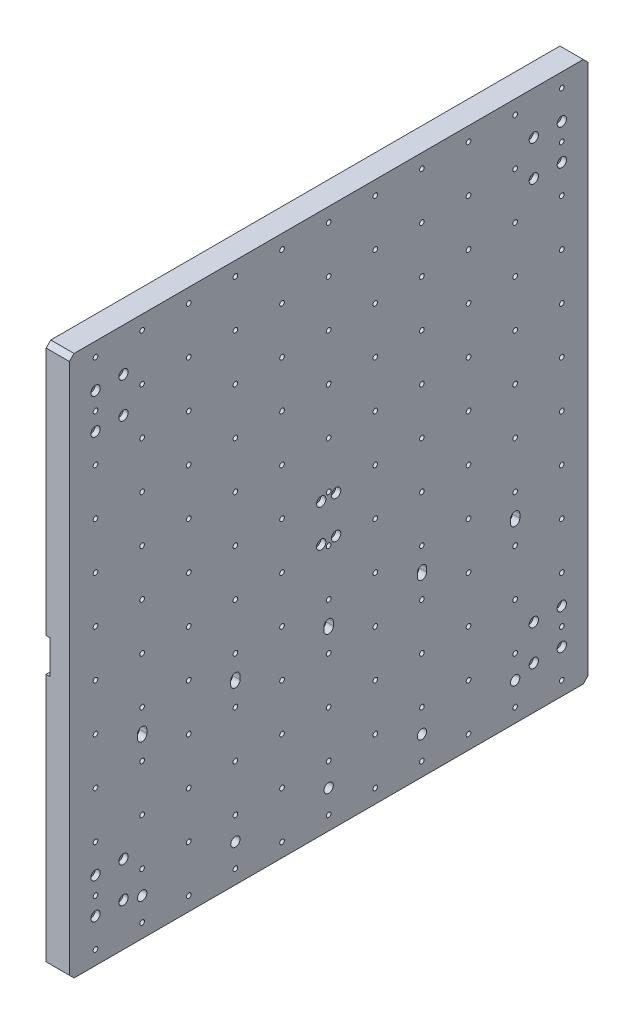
from build123d import *

# Parameters (mm, degrees)
ESQUISSE1_W                                        = 556
ESQUISSE1_H                                        = 580
BOSS_EXTRU_1_DEPTH                                 = 25
CHAMBRAGE_POUR_VIS_T_TE_HEXAGONALE_M51_D           = 5.5
CHAMBRAGE_POUR_VIS_T_TE_HEXAGONALE_M51_CBORE_D     = 10
CHAMBRAGE_POUR_VIS_T_TE_HEXAGONALE_M51_CBORE_DEPTH = 5.4
R_P_TITION_LIN_AIRE1_COUNT                         = 2
R_P_TITION_LIN_AIRE1_PITCH                         = 450
ENL_V_MAT_EXTRU_1_DEPTH                            = 4
ENL_V_MAT_EXTRU_2_DEPTH                            = 9
TROU_TARAUD_M31_D                                  = 2.5
TROU_TARAUD_M31_DEPTH                              = 7.5
TROU_TARAUD_M31_TIP                                = 0.751075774
R_P_TITION_LIN_AIRE2_COUNT                         = 11
R_P_TITION_LIN_AIRE2_PITCH                         = 50
R_P_TITION_LIN_AIRE2_COUNT_DIR2                    = 12
R_P_TITION_LIN_AIRE2_PITCH_DIR2                    = 50
CHANFREIN1_SIZE                                    = 5
ENL_V_MAT_EXTRU_3_DEPTH                            = 8
R_P_TITION_LIN_AIRE4_COUNT                         = 5
R_P_TITION_LIN_AIRE4_PITCH                         = 100
CHAMBRAGE_POUR_VIS_T_TE_HEXAGONALE_M52_D           = 5.5
CHAMBRAGE_POUR_VIS_T_TE_HEXAGONALE_M52_CBORE_D     = 10
CHAMBRAGE_POUR_VIS_T_TE_HEXAGONALE_M52_CBORE_DEPTH = 5.4
ENL_V_MAT_EXTRU_4_DEPTH                            = 4


with BuildPart() as part:
    # Esquisse1 → Boss.-Extru.1 (new body)
    with BuildSketch(Plane(origin=(0, 0, 0), x_dir=(0, 0, -1), z_dir=(1, 0, 0))):
        Rectangle(ESQUISSE1_W, ESQUISSE1_H)
    extrude(amount=-BOSS_EXTRU_1_DEPTH)

    # Chambrage pour vis _ t_te hexagonale M51 (through all)
    with Locations(Plane(origin=(0, 0, 0), x_dir=(0, 0, -1), z_dir=(1, 0, 0))):
        with Locations((-220, 244), (250, 244), (250, 206), (220, 206), (220, 244), (-220, 206), (-250, 206), (-250, 244)):
            chambrage_pour_vis_t_te_hexagonale_m51 = CounterBoreHole(CHAMBRAGE_POUR_VIS_T_TE_HEXAGONALE_M51_D / 2, CHAMBRAGE_POUR_VIS_T_TE_HEXAGONALE_M51_CBORE_D / 2, CHAMBRAGE_POUR_VIS_T_TE_HEXAGONALE_M51_CBORE_DEPTH)

    # R_p_tition lin_aire1: Chambrage pour vis _ t_te hexagonale M51 ×2
    with Locations(*[(0, -i * R_P_TITION_LIN_AIRE1_PITCH, 0) for i in range(1, R_P_TITION_LIN_AIRE1_COUNT)]):
        add(chambrage_pour_vis_t_te_hexagonale_m51, mode=Mode.SUBTRACT)

    # Esquisse24 → Enl_v. mat.-Extru.1 (cut)
    with BuildSketch(Plane(origin=(-25, 0, 0), x_dir=(0, 0, -1), z_dir=(1, 0, 0))):
        with BuildLine():
            Line((-321, 18), (278, 18))
            Line((278, 18), (278, -18))
            Line((278, -18), (-321, -18))
            ThreePointArc((-321, -18), (-321.707106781, -17.707106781), (-322, -17))
            Line((-322, -17), (-322, 17))
            ThreePointArc((-322, 17), (-321.707106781, 17.707106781), (-321, 18))
        make_face()
    extrude(amount=ENL_V_MAT_EXTRU_1_DEPTH, mode=Mode.SUBTRACT)

    # Esquisse25 → Enl_v. mat.-Extru.2 (cut)
    with BuildSketch(Plane.ZY.offset(25)):
        with BuildLine():
            Line((-278, 31), (-163, 31))
            ThreePointArc((-163, 31), (-155.928932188, 28.071067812), (-153, 21))
            Line((-153, 21), (-153, -21))
            ThreePointArc((-153, -21), (-155.928932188, -28.071067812), (-163, -31))
            Line((-163, -31), (-278, -31))
            Line((-278, -31), (-278, 31))
        make_face()
    extrude(amount=-ENL_V_MAT_EXTRU_2_DEPTH, mode=Mode.SUBTRACT)

    # Trou taraud_ M31
    with Locations(Plane.ZY.offset(25)):
        with Locations((-236, -277.5), (-206, -277.5)):
            Hole(TROU_TARAUD_M31_D / 2, depth=TROU_TARAUD_M31_DEPTH)
            with Locations((0, 0, -(TROU_TARAUD_M31_DEPTH + TROU_TARAUD_M31_TIP / 2))):  # 118° drill point
                Cone(0, TROU_TARAUD_M31_D / 2, TROU_TARAUD_M31_TIP, mode=Mode.SUBTRACT)

    # Esquisse29 → Trou taraud_ M61 (revolve, cut)
    with BuildSketch(Plane(origin=(0, -275, -250), x_dir=(0, 0, -1), z_dir=(0, 1, 0))):
        Polygon((0, 0), (0, 16.502151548), (2.5, 15), (2.5, 0), align=None)
    trou_taraud_m61 = revolve(axis=Axis((6.35, -275, -250), (-1, 0, 0)), mode=Mode.SUBTRACT)

    # R_p_tition lin_aire2: Trou taraud_ M61 11 × 12
    with Locations(*[(0, j * R_P_TITION_LIN_AIRE2_PITCH_DIR2, i * R_P_TITION_LIN_AIRE2_PITCH) for i in range(R_P_TITION_LIN_AIRE2_COUNT) for j in range(R_P_TITION_LIN_AIRE2_COUNT_DIR2) if (i, j) != (0, 0)]):
        add(trou_taraud_m61, mode=Mode.SUBTRACT)

    # Chanfrein1
    chanfrein1_edges = [part.edges().sort_by_distance(p)[0] for p in [
        (-12.5, 290, 278),
        (-12.5, 290, -278),
        (-12.5, -290, -278),
        (-12.5, -290, 278),
    ]]
    chamfer(chanfrein1_edges, length=CHANFREIN1_SIZE)

    # Esquisse31 → Diam_tre du per_age _10.0 _10_1 (revolve, cut)
    with BuildSketch(Plane(origin=(0, -250, 200), x_dir=(0, 0, -1), z_dir=(0, 1, 0))):
        Polygon((0, 0), (0, 18.004303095), (5, 15), (5, 0), align=None)
    diam_tre_du_per_age_10_0_10_1 = revolve(axis=Axis((6.35, -250, 200), (-1, 0, 0)), mode=Mode.SUBTRACT)

    # Esquisse32 → Enl_v. mat.-Extru.3 (cut)
    with BuildSketch(Plane(origin=(0, 0, 0), x_dir=(0, 0, -1), z_dir=(1, 0, 0))):
        with BuildLine():
            Line((-195, -98), (-195, -102))
            ThreePointArc((-195, -102), (-200, -107), (-205, -102))
            Line((-205, -102), (-205, -98))
            ThreePointArc((-205, -98), (-200, -93), (-195, -98))
        make_face()
    enl_v_mat_extru_3 = extrude(amount=-ENL_V_MAT_EXTRU_3_DEPTH, mode=Mode.SUBTRACT)

    # R_p_tition lin_aire4: Diam_tre du per_age _10.0 _10_1, Enl_v. mat.-Extru.3 ×5
    with Locations(*[(0, 0, -i * R_P_TITION_LIN_AIRE4_PITCH) for i in range(1, R_P_TITION_LIN_AIRE4_COUNT)]):
        add(diam_tre_du_per_age_10_0_10_1, mode=Mode.SUBTRACT)
        add(enl_v_mat_extru_3, mode=Mode.SUBTRACT)

    # Chambrage pour vis _ t_te hexagonale M52 (through all)
    with Locations(Plane(origin=(0, 0, 0), x_dir=(0, 0, -1), z_dir=(1, 0, 0))):
        with Locations((-8, -20), (-8, 20), (8, 20), (8, -20)):
            CounterBoreHole(CHAMBRAGE_POUR_VIS_T_TE_HEXAGONALE_M52_D / 2, CHAMBRAGE_POUR_VIS_T_TE_HEXAGONALE_M52_CBORE_D / 2, CHAMBRAGE_POUR_VIS_T_TE_HEXAGONALE_M52_CBORE_DEPTH)

    # Esquisse35 → Enl_v. mat.-Extru.4 (cut)
    with BuildSketch(Plane.ZY.offset(25)):
        with BuildLine():
            Line((-82, 31), (11, 31))
            ThreePointArc((11, 31), (15.242640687, 29.242640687), (17, 25))
            Line((17, 25), (17, -25))
            ThreePointArc((17, -25), (15.242640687, -29.242640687), (11, -31))
            Line((11, -31), (-82, -31))
            ThreePointArc((-82, -31), (-86.242640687, -29.242640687), (-88, -25))
            Line((-88, -25), (-88, 25))
            ThreePointArc((-88, 25), (-86.242640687, 29.242640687), (-82, 31))
        make_face()
    extrude(amount=-ENL_V_MAT_EXTRU_4_DEPTH, mode=Mode.SUBTRACT)


solid = part.part
